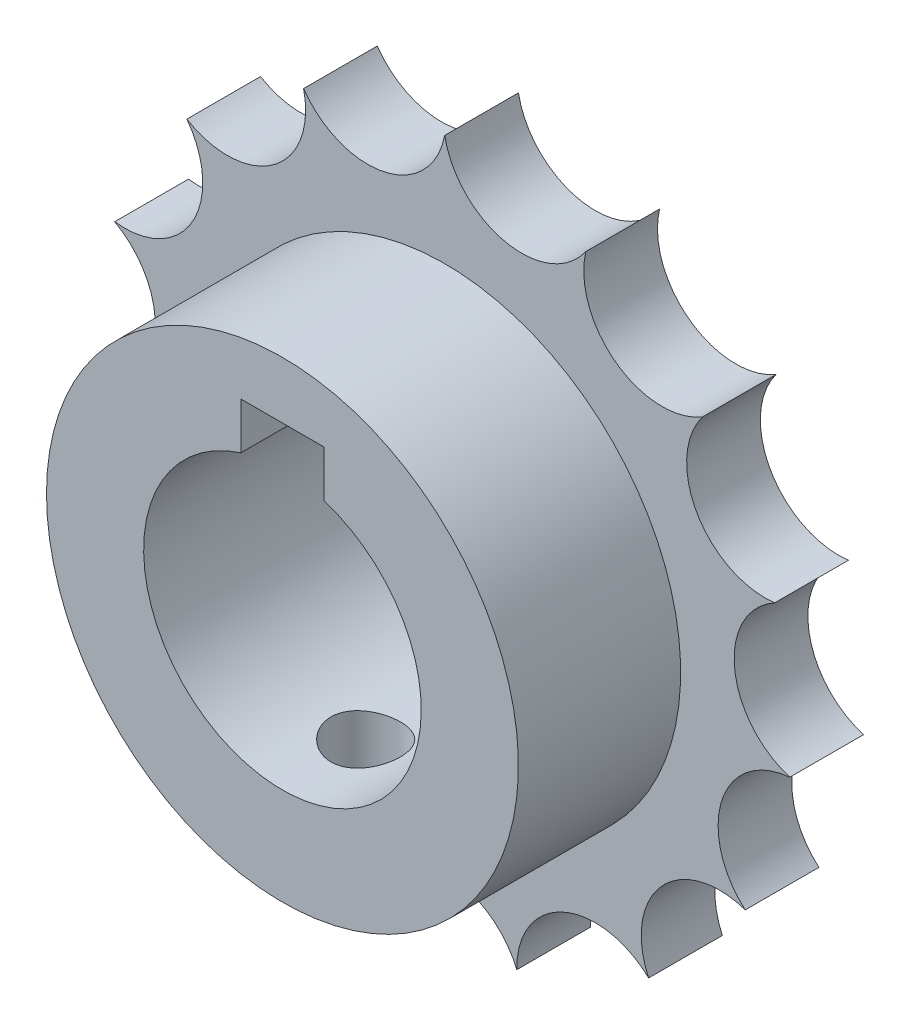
ISO-10303-21;
HEADER;
FILE_DESCRIPTION(('STEP AP214'),'2;1');
FILE_NAME('part.step','',(''),(''),'','','');
FILE_SCHEMA(('AUTOMOTIVE_DESIGN { 1 0 10303 214 1 1 1 1 }'));
ENDSEC;
DATA;
#1=APPLICATION_CONTEXT('core data for automotive mechanical design processes');
#2=APPLICATION_PROTOCOL_DEFINITION('international standard','automotive_design',2000,#1);
#3=PRODUCT_CONTEXT('',#1,'mechanical');
#4=PRODUCT('Part','Part','',(#3));
#5=PRODUCT_RELATED_PRODUCT_CATEGORY('part','',(#4));
#6=PRODUCT_DEFINITION_FORMATION('','',#4);
#7=PRODUCT_DEFINITION_CONTEXT('part definition',#1,'design');
#8=PRODUCT_DEFINITION('design','',#6,#7);
#9=PRODUCT_DEFINITION_SHAPE('','',#8);
#10=(LENGTH_UNIT() NAMED_UNIT(*) SI_UNIT(.MILLI.,.METRE.));
#11=(NAMED_UNIT(*) PLANE_ANGLE_UNIT() SI_UNIT($,.RADIAN.));
#12=(NAMED_UNIT(*) SI_UNIT($,.STERADIAN.) SOLID_ANGLE_UNIT());
#13=UNCERTAINTY_MEASURE_WITH_UNIT(LENGTH_MEASURE(1.E-05),#10,'distance_accuracy_value','');
#14=(GEOMETRIC_REPRESENTATION_CONTEXT(3) GLOBAL_UNCERTAINTY_ASSIGNED_CONTEXT((#13)) GLOBAL_UNIT_ASSIGNED_CONTEXT((#10,
#11,#12)) REPRESENTATION_CONTEXT('',''));
#15=CARTESIAN_POINT('',(0.,0.,0.));
#16=DIRECTION('',(0.,0.,1.));
#17=DIRECTION('',(1.,0.,0.));
#18=AXIS2_PLACEMENT_3D('',#15,#16,#17);
#19=CARTESIAN_POINT('',(-12.2034547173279,-9.45647207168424,0.));
#20=DIRECTION('',(0.,0.,-1.));
#21=DIRECTION('',(-1.,0.,0.));
#22=AXIS2_PLACEMENT_3D('',#19,#20,#21);
#23=PLANE('',#22);
#24=DIRECTION('',(0.,1.,0.));
#25=VECTOR('',#24,1.);
#26=CARTESIAN_POINT('',(-9.20345471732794,3.44352792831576,0.));
#27=LINE('',#26,#25);
#28=CARTESIAN_POINT('',(-9.20345471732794,0.0829199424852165,0.));
#29=VERTEX_POINT('',#28);
#30=CARTESIAN_POINT('',(-9.20345471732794,3.44352792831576,0.));
#31=VERTEX_POINT('',#30);
#32=EDGE_CURVE('E231',#29,#31,#27,.T.);
#33=ORIENTED_EDGE('',*,*,#32,.T.);
#34=DIRECTION('',(1.,0.,0.));
#35=VECTOR('',#34,1.);
#36=CARTESIAN_POINT('',(-15.2034547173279,3.44352792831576,0.));
#37=LINE('',#36,#35);
#38=CARTESIAN_POINT('',(-15.2034547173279,3.44352792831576,0.));
#39=VERTEX_POINT('',#38);
#40=EDGE_CURVE('E228',#31,#39,#37,.F.);
#41=ORIENTED_EDGE('',*,*,#40,.T.);
#42=DIRECTION('',(0.,1.,0.));
#43=VECTOR('',#42,1.);
#44=CARTESIAN_POINT('',(-15.2034547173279,0.082919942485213,0.));
#45=LINE('',#44,#43);
#46=CARTESIAN_POINT('',(-15.2034547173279,0.0829199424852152,0.));
#47=VERTEX_POINT('',#46);
#48=EDGE_CURVE('E224',#39,#47,#45,.F.);
#49=ORIENTED_EDGE('',*,*,#48,.T.);
#50=CARTESIAN_POINT('',(-12.2034547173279,-9.45647207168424,0.));
#51=DIRECTION('',(0.,0.,1.));
#52=DIRECTION('',(1.,0.,0.));
#53=AXIS2_PLACEMENT_3D('',#50,#51,#52);
#54=CIRCLE('',#53,10.);
#55=EDGE_CURVE('E167',#47,#29,#54,.T.);
#56=ORIENTED_EDGE('',*,*,#55,.T.);
#57=EDGE_LOOP('',(#33,#41,#49,#56));
#58=FACE_BOUND('',#57,.T.);
#59=CARTESIAN_POINT('',(-27.8609812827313,12.0942644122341,0.));
#60=DIRECTION('',(0.,0.,1.));
#61=DIRECTION('',(1.,0.,0.));
#62=AXIS2_PLACEMENT_3D('',#59,#60,#61);
#63=CIRCLE('',#62,5.63817525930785);
#64=CARTESIAN_POINT('',(-30.7820753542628,7.27179308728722,0.));
#65=VERTEX_POINT('',#64);
#66=CARTESIAN_POINT('',(-22.3718707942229,13.3821643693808,0.));
#67=VERTEX_POINT('',#66);
#68=EDGE_CURVE('E178',#65,#67,#63,.T.);
#69=ORIENTED_EDGE('',*,*,#68,.T.);
#70=CARTESIAN_POINT('',(-17.7418427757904,16.5995951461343,0.));
#71=DIRECTION('',(0.,0.,1.));
#72=DIRECTION('',(1.,0.,0.));
#73=AXIS2_PLACEMENT_3D('',#70,#71,#72);
#74=CIRCLE('',#73,5.63817525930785);
#75=CARTESIAN_POINT('',(-12.2034547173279,15.5435279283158,0.));
#76=VERTEX_POINT('',#75);
#77=EDGE_CURVE('E149',#67,#76,#74,.T.);
#78=ORIENTED_EDGE('',*,*,#77,.T.);
#79=CARTESIAN_POINT('',(-6.66506665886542,16.5995951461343,0.));
#80=DIRECTION('',(0.,0.,1.));
#81=DIRECTION('',(1.,0.,0.));
#82=AXIS2_PLACEMENT_3D('',#79,#80,#81);
#83=CIRCLE('',#82,5.63817525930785);
#84=CARTESIAN_POINT('',(-2.03503864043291,13.3821643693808,0.));
#85=VERTEX_POINT('',#84);
#86=EDGE_CURVE('E145',#76,#85,#83,.T.);
#87=ORIENTED_EDGE('',*,*,#86,.T.);
#88=CARTESIAN_POINT('',(3.45407184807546,12.0942644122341,0.));
#89=DIRECTION('',(0.,0.,1.));
#90=DIRECTION('',(1.,0.,0.));
#91=AXIS2_PLACEMENT_3D('',#88,#89,#90);
#92=CIRCLE('',#91,5.63817525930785);
#93=CARTESIAN_POINT('',(6.37516591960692,7.2717930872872,0.));
#94=VERTEX_POINT('',#93);
#95=EDGE_CURVE('E19',#85,#94,#92,.T.);
#96=ORIENTED_EDGE('',*,*,#95,.T.);
#97=CARTESIAN_POINT('',(10.8658817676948,3.86261555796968,0.));
#98=DIRECTION('',(0.,0.,1.));
#99=DIRECTION('',(1.,0.,0.));
#100=AXIS2_PLACEMENT_3D('',#97,#98,#99);
#101=CIRCLE('',#100,5.63817525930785);
#102=CARTESIAN_POINT('',(11.5729581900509,-1.73104721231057,0.));
#103=VERTEX_POINT('',#102);
#104=EDGE_CURVE('E222',#94,#103,#101,.T.);
#105=ORIENTED_EDGE('',*,*,#104,.T.);
#106=CARTESIAN_POINT('',(14.2887938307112,-6.67202454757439,0.));
#107=DIRECTION('',(0.,0.,1.));
#108=DIRECTION('',(1.,0.,0.));
#109=AXIS2_PLACEMENT_3D('',#106,#107,#108);
#110=CIRCLE('',#109,5.63817525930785);
#111=CARTESIAN_POINT('',(12.6595926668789,-12.0696836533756,0.));
#112=VERTEX_POINT('',#111);
#113=EDGE_CURVE('E218',#103,#112,#110,.T.);
#114=ORIENTED_EDGE('',*,*,#113,.T.);
#115=CARTESIAN_POINT('',(13.1309554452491,-17.6881209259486,0.));
#116=DIRECTION('',(0.,0.,1.));
#117=DIRECTION('',(1.,0.,0.));
#118=AXIS2_PLACEMENT_3D('',#115,#116,#117);
#119=CIRCLE('',#118,5.63817525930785);
#120=CARTESIAN_POINT('',(9.44718037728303,-21.9564720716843,0.));
#121=VERTEX_POINT('',#120);
#122=EDGE_CURVE('E214',#112,#121,#119,.T.);
#123=ORIENTED_EDGE('',*,*,#122,.T.);
#124=CARTESIAN_POINT('',(7.59256738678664,-27.2808904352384,0.));
#125=DIRECTION('',(0.,0.,1.));
#126=DIRECTION('',(1.,0.,0.));
#127=AXIS2_PLACEMENT_3D('',#124,#125,#126);
#128=CIRCLE('',#127,5.63817525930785);
#129=CARTESIAN_POINT('',(2.49117658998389,-29.6818969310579,0.));
#130=VERTEX_POINT('',#129);
#131=EDGE_CURVE('E210',#121,#130,#128,.T.);
#132=ORIENTED_EDGE('',*,*,#131,.T.);
#133=CARTESIAN_POINT('',(-1.36873273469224,-33.7916560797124,0.));
#134=DIRECTION('',(0.,0.,1.));
#135=DIRECTION('',(1.,0.,0.));
#136=AXIS2_PLACEMENT_3D('',#133,#134,#135);
#137=CIRCLE('',#136,5.63817525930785);
#138=CARTESIAN_POINT('',(-7.00566244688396,-33.9101620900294,0.));
#139=VERTEX_POINT('',#138);
#140=EDGE_CURVE('E206',#130,#139,#137,.T.);
#141=ORIENTED_EDGE('',*,*,#140,.T.);
#142=CARTESIAN_POINT('',(-12.2034547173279,-36.0946473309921,0.));
#143=DIRECTION('',(0.,0.,1.));
#144=DIRECTION('',(1.,0.,0.));
#145=AXIS2_PLACEMENT_3D('',#142,#143,#144);
#146=CIRCLE('',#145,5.63817525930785);
#147=CARTESIAN_POINT('',(-17.4012469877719,-33.9101620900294,0.));
#148=VERTEX_POINT('',#147);
#149=EDGE_CURVE('E202',#139,#148,#146,.T.);
#150=ORIENTED_EDGE('',*,*,#149,.T.);
#151=CARTESIAN_POINT('',(-23.0381766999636,-33.7916560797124,0.));
#152=DIRECTION('',(0.,0.,1.));
#153=DIRECTION('',(1.,0.,0.));
#154=AXIS2_PLACEMENT_3D('',#151,#152,#153);
#155=CIRCLE('',#154,5.63817525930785);
#156=CARTESIAN_POINT('',(-26.8980860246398,-29.6818969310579,0.));
#157=VERTEX_POINT('',#156);
#158=EDGE_CURVE('E198',#148,#157,#155,.T.);
#159=ORIENTED_EDGE('',*,*,#158,.T.);
#160=CARTESIAN_POINT('',(-31.9994768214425,-27.2808904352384,0.));
#161=DIRECTION('',(0.,0.,1.));
#162=DIRECTION('',(1.,0.,0.));
#163=AXIS2_PLACEMENT_3D('',#160,#161,#162);
#164=CIRCLE('',#163,5.63817525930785);
#165=CARTESIAN_POINT('',(-33.8540898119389,-21.9564720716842,0.));
#166=VERTEX_POINT('',#165);
#167=EDGE_CURVE('E194',#157,#166,#164,.T.);
#168=ORIENTED_EDGE('',*,*,#167,.T.);
#169=CARTESIAN_POINT('',(-37.537864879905,-17.6881209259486,0.));
#170=DIRECTION('',(0.,0.,1.));
#171=DIRECTION('',(1.,0.,0.));
#172=AXIS2_PLACEMENT_3D('',#169,#170,#171);
#173=CIRCLE('',#172,5.63817525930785);
#174=CARTESIAN_POINT('',(-37.0665021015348,-12.0696836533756,0.));
#175=VERTEX_POINT('',#174);
#176=EDGE_CURVE('E190',#166,#175,#173,.T.);
#177=ORIENTED_EDGE('',*,*,#176,.T.);
#178=CARTESIAN_POINT('',(-38.695703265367,-6.67202454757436,0.));
#179=DIRECTION('',(0.,0.,1.));
#180=DIRECTION('',(1.,0.,0.));
#181=AXIS2_PLACEMENT_3D('',#178,#179,#180);
#182=CIRCLE('',#181,5.63817525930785);
#183=CARTESIAN_POINT('',(-35.9798676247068,-1.73104721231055,0.));
#184=VERTEX_POINT('',#183);
#185=EDGE_CURVE('E186',#175,#184,#182,.T.);
#186=ORIENTED_EDGE('',*,*,#185,.T.);
#187=CARTESIAN_POINT('',(-35.2727912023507,3.86261555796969,0.));
#188=DIRECTION('',(0.,0.,1.));
#189=DIRECTION('',(1.,0.,0.));
#190=AXIS2_PLACEMENT_3D('',#187,#188,#189);
#191=CIRCLE('',#190,5.63817525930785);
#192=EDGE_CURVE('E182',#184,#65,#191,.T.);
#193=ORIENTED_EDGE('',*,*,#192,.T.);
#194=EDGE_LOOP('',(#69,#78,#87,#96,#105,#114,#123,#132,#141,#150,#159,#168,#177,#186,#193));
#195=FACE_BOUND('',#194,.T.);
#196=ADVANCED_FACE('F16',(#58,#195),#23,.T.);
#197=CARTESIAN_POINT('',(3.45407184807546,12.0942644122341,0.));
#198=DIRECTION('',(0.,0.,1.));
#199=DIRECTION('',(1.,0.,0.));
#200=AXIS2_PLACEMENT_3D('',#197,#198,#199);
#201=CYLINDRICAL_SURFACE('',#200,5.63817525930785);
#202=DIRECTION('',(0.,0.,1.));
#203=VECTOR('',#202,1.);
#204=CARTESIAN_POINT('',(6.37516591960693,7.27179308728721,0.));
#205=LINE('',#204,#203);
#206=CARTESIAN_POINT('',(6.37516591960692,7.2717930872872,5.31));
#207=VERTEX_POINT('',#206);
#208=EDGE_CURVE('E161',#207,#94,#205,.F.);
#209=ORIENTED_EDGE('',*,*,#208,.T.);
#210=ORIENTED_EDGE('',*,*,#95,.F.);
#211=DIRECTION('',(0.,0.,1.));
#212=VECTOR('',#211,1.);
#213=CARTESIAN_POINT('',(-2.03503864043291,13.3821643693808,0.));
#214=LINE('',#213,#212);
#215=CARTESIAN_POINT('',(-2.03503864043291,13.3821643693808,5.31));
#216=VERTEX_POINT('',#215);
#217=EDGE_CURVE('E154',#85,#216,#214,.T.);
#218=ORIENTED_EDGE('',*,*,#217,.T.);
#219=CARTESIAN_POINT('',(3.45407184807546,12.0942644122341,5.31));
#220=DIRECTION('',(0.,0.,1.));
#221=DIRECTION('',(1.,0.,0.));
#222=AXIS2_PLACEMENT_3D('',#219,#220,#221);
#223=CIRCLE('',#222,5.63817525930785);
#224=EDGE_CURVE('E280',#216,#207,#223,.T.);
#225=ORIENTED_EDGE('',*,*,#224,.T.);
#226=EDGE_LOOP('',(#209,#210,#218,#225));
#227=FACE_BOUND('',#226,.T.);
#228=ADVANCED_FACE('F158',(#227),#201,.F.);
#229=CARTESIAN_POINT('',(10.8658817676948,3.86261555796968,0.));
#230=DIRECTION('',(0.,0.,1.));
#231=DIRECTION('',(1.,0.,0.));
#232=AXIS2_PLACEMENT_3D('',#229,#230,#231);
#233=CYLINDRICAL_SURFACE('',#232,5.63817525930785);
#234=DIRECTION('',(0.,0.,1.));
#235=VECTOR('',#234,1.);
#236=CARTESIAN_POINT('',(11.5729581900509,-1.73104721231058,0.));
#237=LINE('',#236,#235);
#238=CARTESIAN_POINT('',(11.5729581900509,-1.73104721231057,5.31));
#239=VERTEX_POINT('',#238);
#240=EDGE_CURVE('E219',#239,#103,#237,.F.);
#241=ORIENTED_EDGE('',*,*,#240,.T.);
#242=ORIENTED_EDGE('',*,*,#104,.F.);
#243=ORIENTED_EDGE('',*,*,#208,.F.);
#244=CARTESIAN_POINT('',(10.8658817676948,3.86261555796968,5.31));
#245=DIRECTION('',(0.,0.,1.));
#246=DIRECTION('',(1.,0.,0.));
#247=AXIS2_PLACEMENT_3D('',#244,#245,#246);
#248=CIRCLE('',#247,5.63817525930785);
#249=EDGE_CURVE('E497',#207,#239,#248,.T.);
#250=ORIENTED_EDGE('',*,*,#249,.T.);
#251=EDGE_LOOP('',(#241,#242,#243,#250));
#252=FACE_BOUND('',#251,.T.);
#253=ADVANCED_FACE('F357',(#252),#233,.F.);
#254=CARTESIAN_POINT('',(14.2887938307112,-6.67202454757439,0.));
#255=DIRECTION('',(0.,0.,1.));
#256=DIRECTION('',(1.,0.,0.));
#257=AXIS2_PLACEMENT_3D('',#254,#255,#256);
#258=CYLINDRICAL_SURFACE('',#257,5.63817525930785);
#259=DIRECTION('',(0.,0.,1.));
#260=VECTOR('',#259,1.);
#261=CARTESIAN_POINT('',(12.6595926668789,-12.0696836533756,0.));
#262=LINE('',#261,#260);
#263=CARTESIAN_POINT('',(12.6595926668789,-12.0696836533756,5.31));
#264=VERTEX_POINT('',#263);
#265=EDGE_CURVE('E215',#264,#112,#262,.F.);
#266=ORIENTED_EDGE('',*,*,#265,.T.);
#267=ORIENTED_EDGE('',*,*,#113,.F.);
#268=ORIENTED_EDGE('',*,*,#240,.F.);
#269=CARTESIAN_POINT('',(14.2887938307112,-6.67202454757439,5.31));
#270=DIRECTION('',(0.,0.,1.));
#271=DIRECTION('',(1.,0.,0.));
#272=AXIS2_PLACEMENT_3D('',#269,#270,#271);
#273=CIRCLE('',#272,5.63817525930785);
#274=EDGE_CURVE('E495',#239,#264,#273,.T.);
#275=ORIENTED_EDGE('',*,*,#274,.T.);
#276=EDGE_LOOP('',(#266,#267,#268,#275));
#277=FACE_BOUND('',#276,.T.);
#278=ADVANCED_FACE('F353',(#277),#258,.F.);
#279=CARTESIAN_POINT('',(13.1309554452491,-17.6881209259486,0.));
#280=DIRECTION('',(0.,0.,1.));
#281=DIRECTION('',(1.,0.,0.));
#282=AXIS2_PLACEMENT_3D('',#279,#280,#281);
#283=CYLINDRICAL_SURFACE('',#282,5.63817525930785);
#284=DIRECTION('',(0.,0.,1.));
#285=VECTOR('',#284,1.);
#286=CARTESIAN_POINT('',(9.44718037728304,-21.9564720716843,0.));
#287=LINE('',#286,#285);
#288=CARTESIAN_POINT('',(9.44718037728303,-21.9564720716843,5.31));
#289=VERTEX_POINT('',#288);
#290=EDGE_CURVE('E211',#289,#121,#287,.F.);
#291=ORIENTED_EDGE('',*,*,#290,.T.);
#292=ORIENTED_EDGE('',*,*,#122,.F.);
#293=ORIENTED_EDGE('',*,*,#265,.F.);
#294=CARTESIAN_POINT('',(13.1309554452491,-17.6881209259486,5.31));
#295=DIRECTION('',(0.,0.,1.));
#296=DIRECTION('',(1.,0.,0.));
#297=AXIS2_PLACEMENT_3D('',#294,#295,#296);
#298=CIRCLE('',#297,5.63817525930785);
#299=EDGE_CURVE('E493',#264,#289,#298,.T.);
#300=ORIENTED_EDGE('',*,*,#299,.T.);
#301=EDGE_LOOP('',(#291,#292,#293,#300));
#302=FACE_BOUND('',#301,.T.);
#303=ADVANCED_FACE('F349',(#302),#283,.F.);
#304=CARTESIAN_POINT('',(7.59256738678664,-27.2808904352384,0.));
#305=DIRECTION('',(0.,0.,1.));
#306=DIRECTION('',(1.,0.,0.));
#307=AXIS2_PLACEMENT_3D('',#304,#305,#306);
#308=CYLINDRICAL_SURFACE('',#307,5.63817525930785);
#309=DIRECTION('',(0.,0.,1.));
#310=VECTOR('',#309,1.);
#311=CARTESIAN_POINT('',(2.49117658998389,-29.6818969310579,0.));
#312=LINE('',#311,#310);
#313=CARTESIAN_POINT('',(2.49117658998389,-29.6818969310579,5.31));
#314=VERTEX_POINT('',#313);
#315=EDGE_CURVE('E207',#314,#130,#312,.F.);
#316=ORIENTED_EDGE('',*,*,#315,.T.);
#317=ORIENTED_EDGE('',*,*,#131,.F.);
#318=ORIENTED_EDGE('',*,*,#290,.F.);
#319=CARTESIAN_POINT('',(7.59256738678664,-27.2808904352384,5.31));
#320=DIRECTION('',(0.,0.,1.));
#321=DIRECTION('',(1.,0.,0.));
#322=AXIS2_PLACEMENT_3D('',#319,#320,#321);
#323=CIRCLE('',#322,5.63817525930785);
#324=EDGE_CURVE('E491',#289,#314,#323,.T.);
#325=ORIENTED_EDGE('',*,*,#324,.T.);
#326=EDGE_LOOP('',(#316,#317,#318,#325));
#327=FACE_BOUND('',#326,.T.);
#328=ADVANCED_FACE('F345',(#327),#308,.F.);
#329=CARTESIAN_POINT('',(-1.36873273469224,-33.7916560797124,0.));
#330=DIRECTION('',(0.,0.,1.));
#331=DIRECTION('',(1.,0.,0.));
#332=AXIS2_PLACEMENT_3D('',#329,#330,#331);
#333=CYLINDRICAL_SURFACE('',#332,5.63817525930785);
#334=DIRECTION('',(0.,0.,1.));
#335=VECTOR('',#334,1.);
#336=CARTESIAN_POINT('',(-7.00566244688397,-33.9101620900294,0.));
#337=LINE('',#336,#335);
#338=CARTESIAN_POINT('',(-7.00566244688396,-33.9101620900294,5.31));
#339=VERTEX_POINT('',#338);
#340=EDGE_CURVE('E203',#339,#139,#337,.F.);
#341=ORIENTED_EDGE('',*,*,#340,.T.);
#342=ORIENTED_EDGE('',*,*,#140,.F.);
#343=ORIENTED_EDGE('',*,*,#315,.F.);
#344=CARTESIAN_POINT('',(-1.36873273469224,-33.7916560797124,5.31));
#345=DIRECTION('',(0.,0.,1.));
#346=DIRECTION('',(1.,0.,0.));
#347=AXIS2_PLACEMENT_3D('',#344,#345,#346);
#348=CIRCLE('',#347,5.63817525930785);
#349=EDGE_CURVE('E489',#314,#339,#348,.T.);
#350=ORIENTED_EDGE('',*,*,#349,.T.);
#351=EDGE_LOOP('',(#341,#342,#343,#350));
#352=FACE_BOUND('',#351,.T.);
#353=ADVANCED_FACE('F341',(#352),#333,.F.);
#354=CARTESIAN_POINT('',(-12.2034547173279,-36.0946473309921,0.));
#355=DIRECTION('',(0.,0.,1.));
#356=DIRECTION('',(1.,0.,0.));
#357=AXIS2_PLACEMENT_3D('',#354,#355,#356);
#358=CYLINDRICAL_SURFACE('',#357,5.63817525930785);
#359=DIRECTION('',(0.,0.,1.));
#360=VECTOR('',#359,1.);
#361=CARTESIAN_POINT('',(-17.4012469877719,-33.9101620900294,0.));
#362=LINE('',#361,#360);
#363=CARTESIAN_POINT('',(-17.4012469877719,-33.9101620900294,5.31));
#364=VERTEX_POINT('',#363);
#365=EDGE_CURVE('E199',#364,#148,#362,.F.);
#366=ORIENTED_EDGE('',*,*,#365,.T.);
#367=ORIENTED_EDGE('',*,*,#149,.F.);
#368=ORIENTED_EDGE('',*,*,#340,.F.);
#369=CARTESIAN_POINT('',(-12.2034547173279,-36.0946473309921,5.31));
#370=DIRECTION('',(0.,0.,1.));
#371=DIRECTION('',(1.,0.,0.));
#372=AXIS2_PLACEMENT_3D('',#369,#370,#371);
#373=CIRCLE('',#372,5.63817525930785);
#374=EDGE_CURVE('E487',#339,#364,#373,.T.);
#375=ORIENTED_EDGE('',*,*,#374,.T.);
#376=EDGE_LOOP('',(#366,#367,#368,#375));
#377=FACE_BOUND('',#376,.T.);
#378=ADVANCED_FACE('F337',(#377),#358,.F.);
#379=CARTESIAN_POINT('',(-23.0381766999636,-33.7916560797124,0.));
#380=DIRECTION('',(0.,0.,1.));
#381=DIRECTION('',(1.,0.,0.));
#382=AXIS2_PLACEMENT_3D('',#379,#380,#381);
#383=CYLINDRICAL_SURFACE('',#382,5.63817525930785);
#384=DIRECTION('',(0.,0.,1.));
#385=VECTOR('',#384,1.);
#386=CARTESIAN_POINT('',(-26.8980860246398,-29.6818969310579,0.));
#387=LINE('',#386,#385);
#388=CARTESIAN_POINT('',(-26.8980860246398,-29.6818969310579,5.31));
#389=VERTEX_POINT('',#388);
#390=EDGE_CURVE('E195',#389,#157,#387,.F.);
#391=ORIENTED_EDGE('',*,*,#390,.T.);
#392=ORIENTED_EDGE('',*,*,#158,.F.);
#393=ORIENTED_EDGE('',*,*,#365,.F.);
#394=CARTESIAN_POINT('',(-23.0381766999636,-33.7916560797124,5.31));
#395=DIRECTION('',(0.,0.,1.));
#396=DIRECTION('',(1.,0.,0.));
#397=AXIS2_PLACEMENT_3D('',#394,#395,#396);
#398=CIRCLE('',#397,5.63817525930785);
#399=EDGE_CURVE('E485',#364,#389,#398,.T.);
#400=ORIENTED_EDGE('',*,*,#399,.T.);
#401=EDGE_LOOP('',(#391,#392,#393,#400));
#402=FACE_BOUND('',#401,.T.);
#403=ADVANCED_FACE('F333',(#402),#383,.F.);
#404=CARTESIAN_POINT('',(-31.9994768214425,-27.2808904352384,0.));
#405=DIRECTION('',(0.,0.,1.));
#406=DIRECTION('',(1.,0.,0.));
#407=AXIS2_PLACEMENT_3D('',#404,#405,#406);
#408=CYLINDRICAL_SURFACE('',#407,5.63817525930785);
#409=DIRECTION('',(0.,0.,1.));
#410=VECTOR('',#409,1.);
#411=CARTESIAN_POINT('',(-33.8540898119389,-21.9564720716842,0.));
#412=LINE('',#411,#410);
#413=CARTESIAN_POINT('',(-33.8540898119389,-21.9564720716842,5.31));
#414=VERTEX_POINT('',#413);
#415=EDGE_CURVE('E191',#414,#166,#412,.F.);
#416=ORIENTED_EDGE('',*,*,#415,.T.);
#417=ORIENTED_EDGE('',*,*,#167,.F.);
#418=ORIENTED_EDGE('',*,*,#390,.F.);
#419=CARTESIAN_POINT('',(-31.9994768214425,-27.2808904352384,5.31));
#420=DIRECTION('',(0.,0.,1.));
#421=DIRECTION('',(1.,0.,0.));
#422=AXIS2_PLACEMENT_3D('',#419,#420,#421);
#423=CIRCLE('',#422,5.63817525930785);
#424=EDGE_CURVE('E483',#389,#414,#423,.T.);
#425=ORIENTED_EDGE('',*,*,#424,.T.);
#426=EDGE_LOOP('',(#416,#417,#418,#425));
#427=FACE_BOUND('',#426,.T.);
#428=ADVANCED_FACE('F329',(#427),#408,.F.);
#429=CARTESIAN_POINT('',(-37.537864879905,-17.6881209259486,0.));
#430=DIRECTION('',(0.,0.,1.));
#431=DIRECTION('',(1.,0.,0.));
#432=AXIS2_PLACEMENT_3D('',#429,#430,#431);
#433=CYLINDRICAL_SURFACE('',#432,5.63817525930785);
#434=DIRECTION('',(0.,0.,1.));
#435=VECTOR('',#434,1.);
#436=CARTESIAN_POINT('',(-37.0665021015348,-12.0696836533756,0.));
#437=LINE('',#436,#435);
#438=CARTESIAN_POINT('',(-37.0665021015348,-12.0696836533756,5.31));
#439=VERTEX_POINT('',#438);
#440=EDGE_CURVE('E187',#439,#175,#437,.F.);
#441=ORIENTED_EDGE('',*,*,#440,.T.);
#442=ORIENTED_EDGE('',*,*,#176,.F.);
#443=ORIENTED_EDGE('',*,*,#415,.F.);
#444=CARTESIAN_POINT('',(-37.537864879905,-17.6881209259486,5.31));
#445=DIRECTION('',(0.,0.,1.));
#446=DIRECTION('',(1.,0.,0.));
#447=AXIS2_PLACEMENT_3D('',#444,#445,#446);
#448=CIRCLE('',#447,5.63817525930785);
#449=EDGE_CURVE('E481',#414,#439,#448,.T.);
#450=ORIENTED_EDGE('',*,*,#449,.T.);
#451=EDGE_LOOP('',(#441,#442,#443,#450));
#452=FACE_BOUND('',#451,.T.);
#453=ADVANCED_FACE('F325',(#452),#433,.F.);
#454=CARTESIAN_POINT('',(-38.695703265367,-6.67202454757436,0.));
#455=DIRECTION('',(0.,0.,1.));
#456=DIRECTION('',(1.,0.,0.));
#457=AXIS2_PLACEMENT_3D('',#454,#455,#456);
#458=CYLINDRICAL_SURFACE('',#457,5.63817525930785);
#459=DIRECTION('',(0.,0.,1.));
#460=VECTOR('',#459,1.);
#461=CARTESIAN_POINT('',(-35.9798676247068,-1.73104721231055,0.));
#462=LINE('',#461,#460);
#463=CARTESIAN_POINT('',(-35.9798676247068,-1.73104721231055,5.31));
#464=VERTEX_POINT('',#463);
#465=EDGE_CURVE('E183',#464,#184,#462,.F.);
#466=ORIENTED_EDGE('',*,*,#465,.T.);
#467=ORIENTED_EDGE('',*,*,#185,.F.);
#468=ORIENTED_EDGE('',*,*,#440,.F.);
#469=CARTESIAN_POINT('',(-38.695703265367,-6.67202454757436,5.31));
#470=DIRECTION('',(0.,0.,1.));
#471=DIRECTION('',(1.,0.,0.));
#472=AXIS2_PLACEMENT_3D('',#469,#470,#471);
#473=CIRCLE('',#472,5.63817525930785);
#474=EDGE_CURVE('E479',#439,#464,#473,.T.);
#475=ORIENTED_EDGE('',*,*,#474,.T.);
#476=EDGE_LOOP('',(#466,#467,#468,#475));
#477=FACE_BOUND('',#476,.T.);
#478=ADVANCED_FACE('F321',(#477),#458,.F.);
#479=CARTESIAN_POINT('',(-35.2727912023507,3.86261555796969,0.));
#480=DIRECTION('',(0.,0.,1.));
#481=DIRECTION('',(1.,0.,0.));
#482=AXIS2_PLACEMENT_3D('',#479,#480,#481);
#483=CYLINDRICAL_SURFACE('',#482,5.63817525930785);
#484=DIRECTION('',(0.,0.,1.));
#485=VECTOR('',#484,1.);
#486=CARTESIAN_POINT('',(-30.7820753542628,7.27179308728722,0.));
#487=LINE('',#486,#485);
#488=CARTESIAN_POINT('',(-30.7820753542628,7.27179308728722,5.31));
#489=VERTEX_POINT('',#488);
#490=EDGE_CURVE('E179',#489,#65,#487,.F.);
#491=ORIENTED_EDGE('',*,*,#490,.T.);
#492=ORIENTED_EDGE('',*,*,#192,.F.);
#493=ORIENTED_EDGE('',*,*,#465,.F.);
#494=CARTESIAN_POINT('',(-35.2727912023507,3.86261555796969,5.31));
#495=DIRECTION('',(0.,0.,1.));
#496=DIRECTION('',(1.,0.,0.));
#497=AXIS2_PLACEMENT_3D('',#494,#495,#496);
#498=CIRCLE('',#497,5.63817525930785);
#499=EDGE_CURVE('E475',#464,#489,#498,.T.);
#500=ORIENTED_EDGE('',*,*,#499,.T.);
#501=EDGE_LOOP('',(#491,#492,#493,#500));
#502=FACE_BOUND('',#501,.T.);
#503=ADVANCED_FACE('F317',(#502),#483,.F.);
#504=CARTESIAN_POINT('',(-27.8609812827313,12.0942644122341,0.));
#505=DIRECTION('',(0.,0.,1.));
#506=DIRECTION('',(1.,0.,0.));
#507=AXIS2_PLACEMENT_3D('',#504,#505,#506);
#508=CYLINDRICAL_SURFACE('',#507,5.63817525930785);
#509=DIRECTION('',(0.,0.,1.));
#510=VECTOR('',#509,1.);
#511=CARTESIAN_POINT('',(-22.3718707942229,13.3821643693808,0.));
#512=LINE('',#511,#510);
#513=CARTESIAN_POINT('',(-22.3718707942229,13.3821643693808,5.31));
#514=VERTEX_POINT('',#513);
#515=EDGE_CURVE('E175',#514,#67,#512,.F.);
#516=ORIENTED_EDGE('',*,*,#515,.T.);
#517=ORIENTED_EDGE('',*,*,#68,.F.);
#518=ORIENTED_EDGE('',*,*,#490,.F.);
#519=CARTESIAN_POINT('',(-27.8609812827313,12.0942644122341,5.31));
#520=DIRECTION('',(0.,0.,1.));
#521=DIRECTION('',(1.,0.,0.));
#522=AXIS2_PLACEMENT_3D('',#519,#520,#521);
#523=CIRCLE('',#522,5.63817525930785);
#524=EDGE_CURVE('E473',#489,#514,#523,.T.);
#525=ORIENTED_EDGE('',*,*,#524,.T.);
#526=EDGE_LOOP('',(#516,#517,#518,#525));
#527=FACE_BOUND('',#526,.T.);
#528=ADVANCED_FACE('F313',(#527),#508,.F.);
#529=CARTESIAN_POINT('',(-17.7418427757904,16.5995951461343,0.));
#530=DIRECTION('',(0.,0.,1.));
#531=DIRECTION('',(1.,0.,0.));
#532=AXIS2_PLACEMENT_3D('',#529,#530,#531);
#533=CYLINDRICAL_SURFACE('',#532,5.63817525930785);
#534=DIRECTION('',(0.,0.,1.));
#535=VECTOR('',#534,1.);
#536=CARTESIAN_POINT('',(-12.2034547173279,15.5435279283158,0.));
#537=LINE('',#536,#535);
#538=CARTESIAN_POINT('',(-12.2034547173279,15.5435279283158,5.31));
#539=VERTEX_POINT('',#538);
#540=EDGE_CURVE('E155',#539,#76,#537,.F.);
#541=ORIENTED_EDGE('',*,*,#540,.T.);
#542=ORIENTED_EDGE('',*,*,#77,.F.);
#543=ORIENTED_EDGE('',*,*,#515,.F.);
#544=CARTESIAN_POINT('',(-17.7418427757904,16.5995951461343,5.31));
#545=DIRECTION('',(0.,0.,1.));
#546=DIRECTION('',(1.,0.,0.));
#547=AXIS2_PLACEMENT_3D('',#544,#545,#546);
#548=CIRCLE('',#547,5.63817525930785);
#549=EDGE_CURVE('E471',#514,#539,#548,.T.);
#550=ORIENTED_EDGE('',*,*,#549,.T.);
#551=EDGE_LOOP('',(#541,#542,#543,#550));
#552=FACE_BOUND('',#551,.T.);
#553=ADVANCED_FACE('F310',(#552),#533,.F.);
#554=CARTESIAN_POINT('',(-6.66506665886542,16.5995951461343,0.));
#555=DIRECTION('',(0.,0.,1.));
#556=DIRECTION('',(1.,0.,0.));
#557=AXIS2_PLACEMENT_3D('',#554,#555,#556);
#558=CYLINDRICAL_SURFACE('',#557,5.63817525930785);
#559=ORIENTED_EDGE('',*,*,#217,.F.);
#560=ORIENTED_EDGE('',*,*,#86,.F.);
#561=ORIENTED_EDGE('',*,*,#540,.F.);
#562=CARTESIAN_POINT('',(-6.66506665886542,16.5995951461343,5.31));
#563=DIRECTION('',(0.,0.,1.));
#564=DIRECTION('',(1.,0.,0.));
#565=AXIS2_PLACEMENT_3D('',#562,#563,#564);
#566=CIRCLE('',#565,5.63817525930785);
#567=EDGE_CURVE('E165',#539,#216,#566,.T.);
#568=ORIENTED_EDGE('',*,*,#567,.T.);
#569=EDGE_LOOP('',(#559,#560,#561,#568));
#570=FACE_BOUND('',#569,.T.);
#571=ADVANCED_FACE('F163',(#570),#558,.F.);
#572=CARTESIAN_POINT('',(-12.2034547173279,-9.45647207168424,0.));
#573=DIRECTION('',(0.,0.,1.));
#574=DIRECTION('',(1.,0.,0.));
#575=AXIS2_PLACEMENT_3D('',#572,#573,#574);
#576=CYLINDRICAL_SURFACE('',#575,10.);
#577=CARTESIAN_POINT('',(-9.70345471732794,-19.1389304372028,11.));
#578=CARTESIAN_POINT('',(-9.70345863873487,-19.1389330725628,11.1380507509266));
#579=CARTESIAN_POINT('',(-9.71492847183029,-19.1419151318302,11.2761448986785));
#580=CARTESIAN_POINT('',(-9.76043159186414,-19.1534906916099,11.5483675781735));
#581=CARTESIAN_POINT('',(-9.79447801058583,-19.1620874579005,11.6824937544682));
#582=CARTESIAN_POINT('',(-9.8839635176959,-19.1838593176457,11.9428035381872));
#583=CARTESIAN_POINT('',(-9.93937498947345,-19.1970284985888,12.0689971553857));
#584=CARTESIAN_POINT('',(-10.0699335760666,-19.2264539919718,12.3103108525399));
#585=CARTESIAN_POINT('',(-10.1450815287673,-19.2427104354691,12.4254304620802));
#586=CARTESIAN_POINT('',(-10.3147462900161,-19.2768792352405,12.6438616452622));
#587=CARTESIAN_POINT('',(-10.4096178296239,-19.2948180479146,12.74689360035));
#588=CARTESIAN_POINT('',(-10.6152726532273,-19.3301008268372,12.9357613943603));
#589=CARTESIAN_POINT('',(-10.7260574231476,-19.3474447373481,13.0215956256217));
#590=CARTESIAN_POINT('',(-10.962309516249,-19.3798762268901,13.1747754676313));
#591=CARTESIAN_POINT('',(-11.0879601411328,-19.3949289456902,13.2418463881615));
#592=CARTESIAN_POINT('',(-11.3491915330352,-19.4207801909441,13.3538096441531));
#593=CARTESIAN_POINT('',(-11.484770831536,-19.4315793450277,13.3987052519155));
#594=CARTESIAN_POINT('',(-11.7590959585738,-19.447519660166,13.4641478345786));
#595=CARTESIAN_POINT('',(-11.897721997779,-19.4527710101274,13.4851696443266));
#596=CARTESIAN_POINT('',(-12.1766258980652,-19.4574080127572,13.5037583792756));
#597=CARTESIAN_POINT('',(-12.316903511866,-19.4567945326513,13.5013287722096));
#598=CARTESIAN_POINT('',(-12.5918353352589,-19.4498530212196,13.4734251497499));
#599=CARTESIAN_POINT('',(-12.7265452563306,-19.443652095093,13.4484636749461));
#600=CARTESIAN_POINT('',(-12.9898003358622,-19.4263804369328,13.3770287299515));
#601=CARTESIAN_POINT('',(-13.118345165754,-19.4153094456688,13.3305541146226));
#602=CARTESIAN_POINT('',(-13.3669714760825,-19.3893471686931,13.2169974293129));
#603=CARTESIAN_POINT('',(-13.4869659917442,-19.3744222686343,13.1497329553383));
#604=CARTESIAN_POINT('',(-13.7141437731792,-19.3423711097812,12.9966443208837));
#605=CARTESIAN_POINT('',(-13.8213248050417,-19.3252444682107,12.9108169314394));
#606=CARTESIAN_POINT('',(-14.0228898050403,-19.2901092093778,12.7202912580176));
#607=CARTESIAN_POINT('',(-14.1168489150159,-19.2720892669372,12.6151451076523));
#608=CARTESIAN_POINT('',(-14.2858956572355,-19.2376225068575,12.3904000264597));
#609=CARTESIAN_POINT('',(-14.360982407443,-19.2211757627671,12.2708004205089));
#610=CARTESIAN_POINT('',(-14.4904250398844,-19.1916770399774,12.0197099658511));
#611=CARTESIAN_POINT('',(-14.5446786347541,-19.1786419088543,11.8881642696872));
#612=CARTESIAN_POINT('',(-14.6301687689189,-19.1576584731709,11.6174145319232));
#613=CARTESIAN_POINT('',(-14.6614102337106,-19.1497090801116,11.4782121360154));
#614=CARTESIAN_POINT('',(-14.6992843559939,-19.1400256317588,11.2000404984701));
#615=CARTESIAN_POINT('',(-14.7065451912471,-19.1381329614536,11.061162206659));
#616=CARTESIAN_POINT('',(-14.6979717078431,-19.1403455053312,10.7841780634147));
#617=CARTESIAN_POINT('',(-14.6821395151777,-19.1444501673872,10.6460721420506));
#618=CARTESIAN_POINT('',(-14.6283801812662,-19.158042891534,10.3768857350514));
#619=CARTESIAN_POINT('',(-14.5908187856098,-19.1674417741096,10.2457272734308));
#620=CARTESIAN_POINT('',(-14.4950727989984,-19.1904792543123,9.99156854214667));
#621=CARTESIAN_POINT('',(-14.4368857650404,-19.2041183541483,9.86856924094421));
#622=CARTESIAN_POINT('',(-14.3002253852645,-19.2344334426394,9.6315587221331));
#623=CARTESIAN_POINT('',(-14.2213764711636,-19.2511637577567,9.51777115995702));
#624=CARTESIAN_POINT('',(-14.0461054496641,-19.2856429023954,9.30481163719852));
#625=CARTESIAN_POINT('',(-13.9496804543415,-19.3033918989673,9.20564208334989));
#626=CARTESIAN_POINT('',(-13.7391115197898,-19.338446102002,9.02218895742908));
#627=CARTESIAN_POINT('',(-13.6245845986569,-19.355729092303,8.93833993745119));
#628=CARTESIAN_POINT('',(-13.3827114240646,-19.3874442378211,8.79106413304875));
#629=CARTESIAN_POINT('',(-13.2553658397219,-19.4018765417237,8.72763628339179));
#630=CARTESIAN_POINT('',(-12.9923502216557,-19.4261732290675,8.62355396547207));
#631=CARTESIAN_POINT('',(-12.8567481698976,-19.4360703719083,8.58273571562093));
#632=CARTESIAN_POINT('',(-12.580329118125,-19.4503250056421,8.52453966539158));
#633=CARTESIAN_POINT('',(-12.439513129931,-19.4546835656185,8.50715734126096));
#634=CARTESIAN_POINT('',(-12.1607459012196,-19.4573263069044,8.49658102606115));
#635=CARTESIAN_POINT('',(-12.0228201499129,-19.455771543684,8.50274572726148));
#636=CARTESIAN_POINT('',(-11.7500359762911,-19.4471194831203,8.53761956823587));
#637=CARTESIAN_POINT('',(-11.6151774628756,-19.4400223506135,8.56632803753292));
#638=CARTESIAN_POINT('',(-11.353027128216,-19.4211078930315,8.64513054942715));
#639=CARTESIAN_POINT('',(-11.2256984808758,-19.4093161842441,8.69510863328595));
#640=CARTESIAN_POINT('',(-10.9811620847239,-19.3822542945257,8.81492644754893));
#641=CARTESIAN_POINT('',(-10.8639556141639,-19.3669836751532,8.88476868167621));
#642=CARTESIAN_POINT('',(-10.6399498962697,-19.3341533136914,9.04428808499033));
#643=CARTESIAN_POINT('',(-10.5334672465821,-19.3165474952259,9.13440035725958));
#644=CARTESIAN_POINT('',(-10.3369171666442,-19.281238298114,9.33105712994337));
#645=CARTESIAN_POINT('',(-10.2468539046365,-19.2635348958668,9.43760579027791));
#646=CARTESIAN_POINT('',(-10.0840496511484,-19.2296589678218,9.66650353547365));
#647=CARTESIAN_POINT('',(-10.011663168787,-19.2135211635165,9.78911030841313));
#648=CARTESIAN_POINT('',(-9.88863747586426,-19.1850709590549,10.045138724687));
#649=CARTESIAN_POINT('',(-9.83798244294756,-19.1727557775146,10.1785524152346));
#650=CARTESIAN_POINT('',(-9.76739839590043,-19.1552697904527,10.4264425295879));
#651=CARTESIAN_POINT('',(-9.74347179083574,-19.1491886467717,10.5397329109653));
#652=CARTESIAN_POINT('',(-9.71149898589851,-19.1410180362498,10.7686721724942));
#653=CARTESIAN_POINT('',(-9.70345143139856,-19.1389282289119,10.884320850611));
#654=CARTESIAN_POINT('',(-9.70345471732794,-19.1389304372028,11.));
#655=B_SPLINE_CURVE_WITH_KNOTS('',3,(#577,#578,#579,#580,#581,#582,#583,#584,#585,#586,#587,
#588,#589,#590,#591,#592,#593,#594,#595,#596,#597,#598,#599,#600,#601,#602,#603,#604,#605,#606,
#607,#608,#609,#610,#611,#612,#613,#614,#615,#616,#617,#618,#619,#620,#621,#622,#623,#624,#625,
#626,#627,#628,#629,#630,#631,#632,#633,#634,#635,#636,#637,#638,#639,#640,#641,#642,#643,#644,
#645,#646,#647,#648,#649,#650,#651,#652,#653,#654),.UNSPECIFIED.,.T.,.F.,(4,2,2,2,2,2,2,2,2,2,2,
2,2,2,2,2,2,2,2,2,2,2,2,2,2,2,2,2,2,2,2,2,2,2,2,2,2,2,4),(0.,0.413727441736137,
0.827695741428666,1.24113072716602,1.65458326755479,2.07623954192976,2.49793521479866,
2.9255149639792,3.35303159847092,3.77188750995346,4.1906814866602,4.60018262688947,
5.00970556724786,5.42292874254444,5.83622385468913,6.26070466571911,6.68520531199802,
7.11176432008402,7.53823200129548,7.95343574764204,8.36860127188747,8.77697405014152,
9.18539521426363,9.60182845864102,10.0183301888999,10.4452533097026,10.872154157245,
11.2959207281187,11.7196054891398,12.131834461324,12.5440511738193,12.9540487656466,
13.3640980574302,13.7839709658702,14.2039503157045,14.6317647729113,15.0592672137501,
15.4059782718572,15.7526597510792),.UNSPECIFIED.);
#656=CARTESIAN_POINT('',(-9.70345471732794,-19.1389304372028,11.));
#657=VERTEX_POINT('',#656);
#658=EDGE_CURVE('E294',#657,#657,#655,.T.);
#659=ORIENTED_EDGE('',*,*,#658,.T.);
#660=EDGE_LOOP('',(#659));
#661=FACE_BOUND('',#660,.T.);
#662=DIRECTION('',(0.,0.,-1.));
#663=VECTOR('',#662,1.);
#664=CARTESIAN_POINT('',(-9.20345471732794,0.082919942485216,0.));
#665=LINE('',#664,#663);
#666=CARTESIAN_POINT('',(-9.20345471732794,0.0829199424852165,17.));
#667=VERTEX_POINT('',#666);
#668=EDGE_CURVE('E169',#667,#29,#665,.T.);
#669=ORIENTED_EDGE('',*,*,#668,.T.);
#670=ORIENTED_EDGE('',*,*,#55,.F.);
#671=DIRECTION('',(0.,0.,1.));
#672=VECTOR('',#671,1.);
#673=CARTESIAN_POINT('',(-15.2034547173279,0.082919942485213,0.));
#674=LINE('',#673,#672);
#675=CARTESIAN_POINT('',(-15.2034547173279,0.0829199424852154,17.));
#676=VERTEX_POINT('',#675);
#677=EDGE_CURVE('E226',#47,#676,#674,.T.);
#678=ORIENTED_EDGE('',*,*,#677,.T.);
#679=CARTESIAN_POINT('',(-12.2034547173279,-9.45647207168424,17.));
#680=DIRECTION('',(0.,0.,1.));
#681=DIRECTION('',(1.,0.,0.));
#682=AXIS2_PLACEMENT_3D('',#679,#680,#681);
#683=CIRCLE('',#682,10.);
#684=EDGE_CURVE('E278',#676,#667,#683,.T.);
#685=ORIENTED_EDGE('',*,*,#684,.T.);
#686=EDGE_LOOP('',(#669,#670,#678,#685));
#687=FACE_BOUND('',#686,.T.);
#688=ADVANCED_FACE('F293',(#661,#687),#576,.F.);
#689=CARTESIAN_POINT('',(-9.20345471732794,3.44352792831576,0.));
#690=DIRECTION('',(1.,0.,0.));
#691=DIRECTION('',(0.,0.,-1.));
#692=AXIS2_PLACEMENT_3D('',#689,#690,#691);
#693=PLANE('',#692);
#694=DIRECTION('',(0.,0.,1.));
#695=VECTOR('',#694,1.);
#696=CARTESIAN_POINT('',(-9.20345471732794,3.44352792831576,0.));
#697=LINE('',#696,#695);
#698=CARTESIAN_POINT('',(-9.20345471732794,3.44352792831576,17.));
#699=VERTEX_POINT('',#698);
#700=EDGE_CURVE('E230',#699,#31,#697,.F.);
#701=ORIENTED_EDGE('',*,*,#700,.T.);
#702=ORIENTED_EDGE('',*,*,#32,.F.);
#703=ORIENTED_EDGE('',*,*,#668,.F.);
#704=DIRECTION('',(0.,1.,0.));
#705=VECTOR('',#704,1.);
#706=CARTESIAN_POINT('',(-9.20345471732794,-9.45647207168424,17.));
#707=LINE('',#706,#705);
#708=EDGE_CURVE('E274',#667,#699,#707,.T.);
#709=ORIENTED_EDGE('',*,*,#708,.T.);
#710=EDGE_LOOP('',(#701,#702,#703,#709));
#711=FACE_BOUND('',#710,.T.);
#712=ADVANCED_FACE('F285',(#711),#693,.F.);
#713=CARTESIAN_POINT('',(-15.2034547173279,3.44352792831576,0.));
#714=DIRECTION('',(0.,1.,0.));
#715=DIRECTION('',(0.,0.,1.));
#716=AXIS2_PLACEMENT_3D('',#713,#714,#715);
#717=PLANE('',#716);
#718=DIRECTION('',(0.,0.,1.));
#719=VECTOR('',#718,1.);
#720=CARTESIAN_POINT('',(-15.2034547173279,3.44352792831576,0.));
#721=LINE('',#720,#719);
#722=CARTESIAN_POINT('',(-15.2034547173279,3.44352792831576,17.));
#723=VERTEX_POINT('',#722);
#724=EDGE_CURVE('E227',#723,#39,#721,.F.);
#725=ORIENTED_EDGE('',*,*,#724,.T.);
#726=ORIENTED_EDGE('',*,*,#40,.F.);
#727=ORIENTED_EDGE('',*,*,#700,.F.);
#728=DIRECTION('',(-1.,0.,0.));
#729=VECTOR('',#728,1.);
#730=CARTESIAN_POINT('',(-12.2034547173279,3.44352792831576,17.));
#731=LINE('',#730,#729);
#732=EDGE_CURVE('E34',#699,#723,#731,.T.);
#733=ORIENTED_EDGE('',*,*,#732,.T.);
#734=EDGE_LOOP('',(#725,#726,#727,#733));
#735=FACE_BOUND('',#734,.T.);
#736=ADVANCED_FACE('F287',(#735),#717,.F.);
#737=CARTESIAN_POINT('',(-15.2034547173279,0.082919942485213,0.));
#738=DIRECTION('',(-1.,0.,0.));
#739=DIRECTION('',(0.,0.,1.));
#740=AXIS2_PLACEMENT_3D('',#737,#738,#739);
#741=PLANE('',#740);
#742=ORIENTED_EDGE('',*,*,#677,.F.);
#743=ORIENTED_EDGE('',*,*,#48,.F.);
#744=ORIENTED_EDGE('',*,*,#724,.F.);
#745=DIRECTION('',(0.,1.,0.));
#746=VECTOR('',#745,1.);
#747=CARTESIAN_POINT('',(-15.2034547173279,-9.45647207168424,17.));
#748=LINE('',#747,#746);
#749=EDGE_CURVE('E268',#723,#676,#748,.F.);
#750=ORIENTED_EDGE('',*,*,#749,.T.);
#751=EDGE_LOOP('',(#742,#743,#744,#750));
#752=FACE_BOUND('',#751,.T.);
#753=ADVANCED_FACE('F446',(#752),#741,.F.);
#754=CARTESIAN_POINT('',(-12.2034547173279,-9.45647207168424,5.31));
#755=DIRECTION('',(0.,0.,-1.));
#756=DIRECTION('',(-1.,0.,0.));
#757=AXIS2_PLACEMENT_3D('',#754,#755,#756);
#758=PLANE('',#757);
#759=CARTESIAN_POINT('',(-12.2034547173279,-9.45647207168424,5.31));
#760=DIRECTION('',(0.,0.,-1.));
#761=DIRECTION('',(-1.,0.,0.));
#762=AXIS2_PLACEMENT_3D('',#759,#760,#761);
#763=CIRCLE('',#762,17.);
#764=CARTESIAN_POINT('',(-29.2034547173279,-9.45647207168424,5.31));
#765=VERTEX_POINT('',#764);
#766=EDGE_CURVE('E239',#765,#765,#763,.F.);
#767=ORIENTED_EDGE('',*,*,#766,.F.);
#768=EDGE_LOOP('',(#767));
#769=FACE_BOUND('',#768,.T.);
#770=ORIENTED_EDGE('',*,*,#549,.F.);
#771=ORIENTED_EDGE('',*,*,#524,.F.);
#772=ORIENTED_EDGE('',*,*,#499,.F.);
#773=ORIENTED_EDGE('',*,*,#474,.F.);
#774=ORIENTED_EDGE('',*,*,#449,.F.);
#775=ORIENTED_EDGE('',*,*,#424,.F.);
#776=ORIENTED_EDGE('',*,*,#399,.F.);
#777=ORIENTED_EDGE('',*,*,#374,.F.);
#778=ORIENTED_EDGE('',*,*,#349,.F.);
#779=ORIENTED_EDGE('',*,*,#324,.F.);
#780=ORIENTED_EDGE('',*,*,#299,.F.);
#781=ORIENTED_EDGE('',*,*,#274,.F.);
#782=ORIENTED_EDGE('',*,*,#249,.F.);
#783=ORIENTED_EDGE('',*,*,#224,.F.);
#784=ORIENTED_EDGE('',*,*,#567,.F.);
#785=EDGE_LOOP('',(#770,#771,#772,#773,#774,#775,#776,#777,#778,#779,#780,#781,#782,#783,#784));
#786=FACE_BOUND('',#785,.T.);
#787=ADVANCED_FACE('F256',(#769,#786),#758,.F.);
#788=CARTESIAN_POINT('',(-12.2034547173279,3.44352792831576,11.));
#789=DIRECTION('',(0.,-1.,0.));
#790=DIRECTION('',(0.,0.,-1.));
#791=AXIS2_PLACEMENT_3D('',#788,#789,#790);
#792=CYLINDRICAL_SURFACE('',#791,2.5);
#793=ORIENTED_EDGE('',*,*,#658,.F.);
#794=EDGE_LOOP('',(#793));
#795=FACE_BOUND('',#794,.T.);
#796=CARTESIAN_POINT('',(-14.7034547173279,-26.2716437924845,11.));
#797=CARTESIAN_POINT('',(-14.7034489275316,-26.2716460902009,11.1396090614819));
#798=CARTESIAN_POINT('',(-14.6917207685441,-26.273401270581,11.2792999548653));
#799=CARTESIAN_POINT('',(-14.6451291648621,-26.280227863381,11.5547784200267));
#800=CARTESIAN_POINT('',(-14.6102429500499,-26.2853025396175,11.6905620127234));
#801=CARTESIAN_POINT('',(-14.5183995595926,-26.2981812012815,11.9541983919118));
#802=CARTESIAN_POINT('',(-14.4614590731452,-26.3059831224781,12.0820570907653));
#803=CARTESIAN_POINT('',(-14.3271623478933,-26.32343474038,12.3263864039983));
#804=CARTESIAN_POINT('',(-14.2498090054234,-26.3330841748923,12.4428586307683));
#805=CARTESIAN_POINT('',(-14.0762460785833,-26.3532266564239,12.6620243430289));
#806=CARTESIAN_POINT('',(-13.9799103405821,-26.3637250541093,12.7646174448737));
#807=CARTESIAN_POINT('',(-13.7713895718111,-26.3843347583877,12.9522431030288));
#808=CARTESIAN_POINT('',(-13.659203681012,-26.3944460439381,13.0372747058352));
#809=CARTESIAN_POINT('',(-13.4215254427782,-26.4131981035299,13.1877328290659));
#810=CARTESIAN_POINT('',(-13.295974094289,-26.4218318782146,13.2530670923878));
#811=CARTESIAN_POINT('',(-13.0355319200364,-26.4365969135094,13.3616840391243));
#812=CARTESIAN_POINT('',(-12.9006415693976,-26.4427283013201,13.4049678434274));
#813=CARTESIAN_POINT('',(-12.6263835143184,-26.4517599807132,13.4679514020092));
#814=CARTESIAN_POINT('',(-12.4870551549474,-26.4546832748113,13.4878191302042));
#815=CARTESIAN_POINT('',(-12.20701363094,-26.457048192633,13.5039280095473));
#816=CARTESIAN_POINT('',(-12.0663005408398,-26.4564900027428,13.5001704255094));
#817=CARTESIAN_POINT('',(-11.788629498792,-26.4519732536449,13.4692681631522));
#818=CARTESIAN_POINT('',(-11.6516509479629,-26.448040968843,13.4423041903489));
#819=CARTESIAN_POINT('',(-11.384184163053,-26.437247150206,13.3660380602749));
#820=CARTESIAN_POINT('',(-11.2536960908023,-26.4303855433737,13.3167353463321));
#821=CARTESIAN_POINT('',(-11.0023658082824,-26.4144588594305,13.1970053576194));
#822=CARTESIAN_POINT('',(-10.8815604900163,-26.405385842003,13.1265017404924));
#823=CARTESIAN_POINT('',(-10.6534272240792,-26.3860480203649,12.9664269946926));
#824=CARTESIAN_POINT('',(-10.5461001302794,-26.3757831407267,12.8768546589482));
#825=CARTESIAN_POINT('',(-10.3469051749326,-26.3550923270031,12.6801777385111));
#826=CARTESIAN_POINT('',(-10.2551930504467,-26.3446657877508,12.5729154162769));
#827=CARTESIAN_POINT('',(-10.0910467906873,-26.3249215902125,12.3444399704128));
#828=CARTESIAN_POINT('',(-10.0186127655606,-26.3156039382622,12.2232267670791));
#829=CARTESIAN_POINT('',(-9.89505934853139,-26.2991327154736,11.9701310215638));
#830=CARTESIAN_POINT('',(-9.84395551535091,-26.2919807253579,11.8382407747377));
#831=CARTESIAN_POINT('',(-9.76466744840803,-26.2806789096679,11.5676208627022));
#832=CARTESIAN_POINT('',(-9.73648166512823,-26.2765288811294,11.4288916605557));
#833=CARTESIAN_POINT('',(-9.70404244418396,-26.2717392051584,11.149916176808));
#834=CARTESIAN_POINT('',(-9.69956844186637,-26.2710672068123,11.009696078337));
#835=CARTESIAN_POINT('',(-9.71409494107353,-26.2732238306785,10.7305081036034));
#836=CARTESIAN_POINT('',(-9.73309474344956,-26.2760523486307,10.5915401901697));
#837=CARTESIAN_POINT('',(-9.79384261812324,-26.2848616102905,10.3194818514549));
#838=CARTESIAN_POINT('',(-9.83548119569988,-26.290827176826,10.1863664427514));
#839=CARTESIAN_POINT('',(-9.94021090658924,-26.3052258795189,9.92900467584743));
#840=CARTESIAN_POINT('',(-10.0033030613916,-26.3136591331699,9.80475874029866));
#841=CARTESIAN_POINT('',(-10.1496804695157,-26.332119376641,9.56767291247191));
#842=CARTESIAN_POINT('',(-10.2331087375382,-26.3421574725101,9.45492219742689));
#843=CARTESIAN_POINT('',(-10.4175909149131,-26.3626627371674,9.24494324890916));
#844=CARTESIAN_POINT('',(-10.5186457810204,-26.373129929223,9.14771585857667));
#845=CARTESIAN_POINT('',(-10.7364829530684,-26.3934148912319,8.97075356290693));
#846=CARTESIAN_POINT('',(-10.8533845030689,-26.4032268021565,8.89116467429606));
#847=CARTESIAN_POINT('',(-11.0990260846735,-26.4210050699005,8.75275504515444));
#848=CARTESIAN_POINT('',(-11.2277658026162,-26.4289714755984,8.69393375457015));
#849=CARTESIAN_POINT('',(-11.4929696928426,-26.4421354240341,8.59896334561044));
#850=CARTESIAN_POINT('',(-11.6294045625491,-26.447342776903,8.56273381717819));
#851=CARTESIAN_POINT('',(-11.9065036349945,-26.4544430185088,8.51371493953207));
#852=CARTESIAN_POINT('',(-12.0471675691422,-26.4563361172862,8.50092410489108));
#853=CARTESIAN_POINT('',(-12.3273144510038,-26.4565925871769,8.4991808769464));
#854=CARTESIAN_POINT('',(-12.4667960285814,-26.4549890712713,8.51000485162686));
#855=CARTESIAN_POINT('',(-12.741933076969,-26.4484991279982,8.55470536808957));
#856=CARTESIAN_POINT('',(-12.8775885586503,-26.4436127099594,8.58858184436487));
#857=CARTESIAN_POINT('',(-13.1411652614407,-26.4311034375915,8.67834751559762));
#858=CARTESIAN_POINT('',(-13.2690916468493,-26.4234824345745,8.73422182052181));
#859=CARTESIAN_POINT('',(-13.5137885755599,-26.4063419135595,8.8663733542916));
#860=CARTESIAN_POINT('',(-13.6305587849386,-26.3968223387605,8.94265119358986));
#861=CARTESIAN_POINT('',(-13.8507641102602,-26.3768362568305,9.11425567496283));
#862=CARTESIAN_POINT('',(-13.9540697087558,-26.3663619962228,9.20974762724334));
#863=CARTESIAN_POINT('',(-14.1432723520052,-26.3457050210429,9.41672202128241));
#864=CARTESIAN_POINT('',(-14.2291653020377,-26.3355223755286,9.52820821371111));
#865=CARTESIAN_POINT('',(-14.3815179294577,-26.3165427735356,9.76471097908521));
#866=CARTESIAN_POINT('',(-14.4478704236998,-26.3077535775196,9.88979720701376));
#867=CARTESIAN_POINT('',(-14.5585261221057,-26.2926469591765,10.1494074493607));
#868=CARTESIAN_POINT('',(-14.6028523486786,-26.286326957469,10.2839214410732));
#869=CARTESIAN_POINT('',(-14.6580668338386,-26.2783439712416,10.5158765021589));
#870=CARTESIAN_POINT('',(-14.6750614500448,-26.2758446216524,10.6118807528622));
#871=CARTESIAN_POINT('',(-14.6977573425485,-26.2724937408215,10.8052434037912));
#872=CARTESIAN_POINT('',(-14.7034587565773,-26.2716421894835,10.9026017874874));
#873=CARTESIAN_POINT('',(-14.7034547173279,-26.2716437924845,11.));
#874=B_SPLINE_CURVE_WITH_KNOTS('',3,(#796,#797,#798,#799,#800,#801,#802,#803,#804,#805,#806,
#807,#808,#809,#810,#811,#812,#813,#814,#815,#816,#817,#818,#819,#820,#821,#822,#823,#824,#825,
#826,#827,#828,#829,#830,#831,#832,#833,#834,#835,#836,#837,#838,#839,#840,#841,#842,#843,#844,
#845,#846,#847,#848,#849,#850,#851,#852,#853,#854,#855,#856,#857,#858,#859,#860,#861,#862,#863,
#864,#865,#866,#867,#868,#869,#870,#871,#872,#873),.UNSPECIFIED.,.T.,.F.,(4,2,2,2,2,2,2,2,2,2,2,
2,2,2,2,2,2,2,2,2,2,2,2,2,2,2,2,2,2,2,2,2,2,2,2,2,2,2,4),(0.,0.41847120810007,0.837354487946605,
1.25592140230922,1.67442895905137,2.09581782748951,2.51722956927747,2.94058547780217,
3.36391986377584,3.78419863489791,4.2044549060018,4.62146799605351,5.03849147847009,
5.45703497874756,5.87560498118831,6.29813197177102,6.72066137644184,7.14349844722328,
7.56630692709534,7.98517549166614,8.40403158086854,8.82087962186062,9.23774751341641,
9.65763620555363,10.0775476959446,10.5008152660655,10.9240716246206,11.3458127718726,
11.7675271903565,12.1852653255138,12.6030022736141,13.0204569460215,13.4379241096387,
13.8591496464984,14.2804741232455,14.7040683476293,15.1272188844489,15.4191687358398,
15.7111150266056),.UNSPECIFIED.);
#875=CARTESIAN_POINT('',(-14.7034547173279,-26.2716437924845,11.));
#876=VERTEX_POINT('',#875);
#877=EDGE_CURVE('E25',#876,#876,#874,.T.);
#878=ORIENTED_EDGE('',*,*,#877,.F.);
#879=EDGE_LOOP('',(#878));
#880=FACE_BOUND('',#879,.T.);
#881=ADVANCED_FACE('F241',(#795,#880),#792,.F.);
#882=CARTESIAN_POINT('',(-12.2034547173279,-9.45647207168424,17.));
#883=DIRECTION('',(0.,0.,-1.));
#884=DIRECTION('',(-1.,0.,0.));
#885=AXIS2_PLACEMENT_3D('',#882,#883,#884);
#886=PLANE('',#885);
#887=ORIENTED_EDGE('',*,*,#732,.F.);
#888=ORIENTED_EDGE('',*,*,#708,.F.);
#889=ORIENTED_EDGE('',*,*,#684,.F.);
#890=ORIENTED_EDGE('',*,*,#749,.F.);
#891=EDGE_LOOP('',(#887,#888,#889,#890));
#892=FACE_BOUND('',#891,.T.);
#893=CARTESIAN_POINT('',(-12.2034547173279,-9.45647207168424,17.));
#894=DIRECTION('',(0.,0.,-1.));
#895=DIRECTION('',(-1.,0.,0.));
#896=AXIS2_PLACEMENT_3D('',#893,#894,#895);
#897=CIRCLE('',#896,17.);
#898=CARTESIAN_POINT('',(-29.2034547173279,-9.45647207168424,17.));
#899=VERTEX_POINT('',#898);
#900=EDGE_CURVE('E11',#899,#899,#897,.T.);
#901=ORIENTED_EDGE('',*,*,#900,.F.);
#902=EDGE_LOOP('',(#901));
#903=FACE_BOUND('',#902,.T.);
#904=ADVANCED_FACE('F248',(#892,#903),#886,.F.);
#905=CARTESIAN_POINT('',(-12.2034547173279,-9.45647207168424,17.));
#906=DIRECTION('',(0.,0.,-1.));
#907=DIRECTION('',(-1.,0.,0.));
#908=AXIS2_PLACEMENT_3D('',#905,#906,#907);
#909=CYLINDRICAL_SURFACE('',#908,17.);
#910=ORIENTED_EDGE('',*,*,#900,.T.);
#911=EDGE_LOOP('',(#910));
#912=FACE_BOUND('',#911,.T.);
#913=ORIENTED_EDGE('',*,*,#877,.T.);
#914=EDGE_LOOP('',(#913));
#915=FACE_BOUND('',#914,.T.);
#916=ORIENTED_EDGE('',*,*,#766,.T.);
#917=EDGE_LOOP('',(#916));
#918=FACE_BOUND('',#917,.T.);
#919=ADVANCED_FACE('F245',(#912,#915,#918),#909,.T.);
#920=CLOSED_SHELL('',(#196,#228,#253,#278,#303,#328,#353,#378,#403,#428,#453,#478,#503,#528,
#553,#571,#688,#712,#736,#753,#787,#881,#904,#919));
#921=MANIFOLD_SOLID_BREP('B1',#920);
#922=ADVANCED_BREP_SHAPE_REPRESENTATION('',(#18,#921),#14);
#923=SHAPE_DEFINITION_REPRESENTATION(#9,#922);
ENDSEC;
END-ISO-10303-21;
